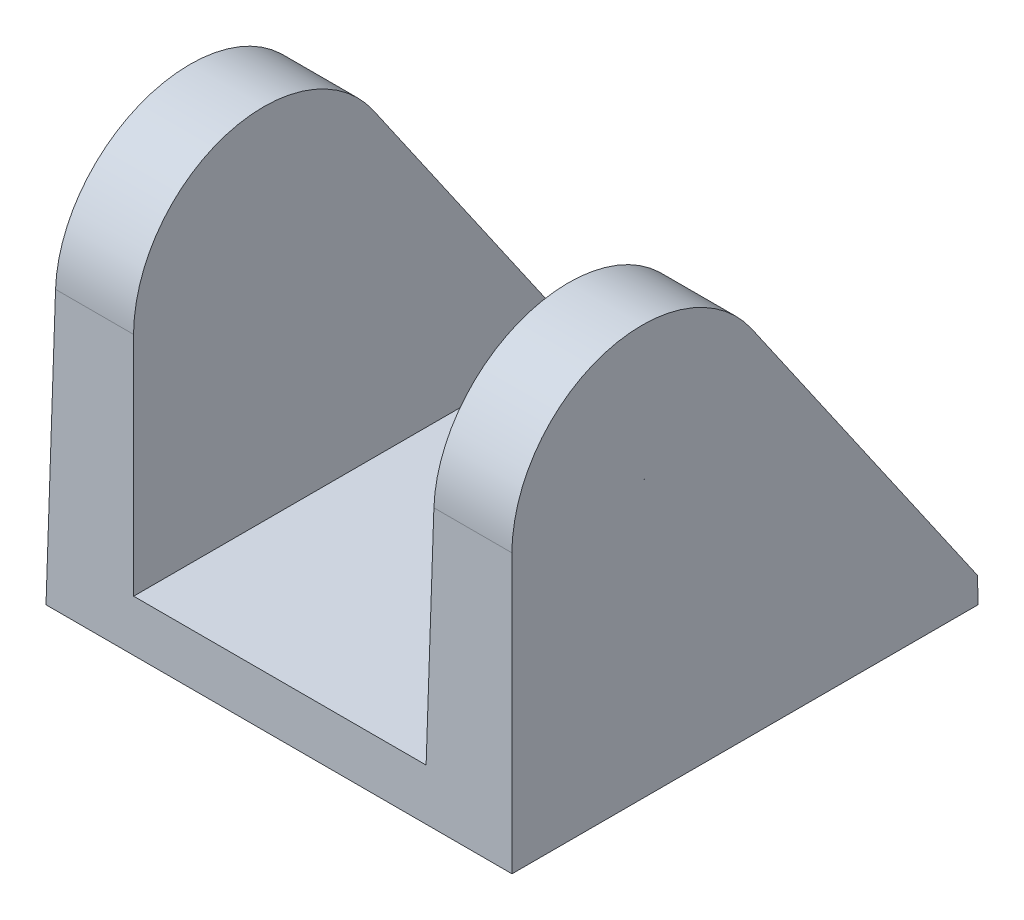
ISO-10303-21;
HEADER;
FILE_DESCRIPTION(('STEP AP214'),'2;1');
FILE_NAME('part.step','',(''),(''),'','','');
FILE_SCHEMA(('AUTOMOTIVE_DESIGN { 1 0 10303 214 1 1 1 1 }'));
ENDSEC;
DATA;
#1=APPLICATION_CONTEXT('core data for automotive mechanical design processes');
#2=APPLICATION_PROTOCOL_DEFINITION('international standard','automotive_design',2000,#1);
#3=PRODUCT_CONTEXT('',#1,'mechanical');
#4=PRODUCT('Part','Part','',(#3));
#5=PRODUCT_RELATED_PRODUCT_CATEGORY('part','',(#4));
#6=PRODUCT_DEFINITION_FORMATION('','',#4);
#7=PRODUCT_DEFINITION_CONTEXT('part definition',#1,'design');
#8=PRODUCT_DEFINITION('design','',#6,#7);
#9=PRODUCT_DEFINITION_SHAPE('','',#8);
#10=(LENGTH_UNIT() NAMED_UNIT(*) SI_UNIT(.MILLI.,.METRE.));
#11=(NAMED_UNIT(*) PLANE_ANGLE_UNIT() SI_UNIT($,.RADIAN.));
#12=(NAMED_UNIT(*) SI_UNIT($,.STERADIAN.) SOLID_ANGLE_UNIT());
#13=UNCERTAINTY_MEASURE_WITH_UNIT(LENGTH_MEASURE(1.E-05),#10,'distance_accuracy_value','');
#14=(GEOMETRIC_REPRESENTATION_CONTEXT(3) GLOBAL_UNCERTAINTY_ASSIGNED_CONTEXT((#13)) GLOBAL_UNIT_ASSIGNED_CONTEXT((#10,
#11,#12)) REPRESENTATION_CONTEXT('',''));
#15=CARTESIAN_POINT('',(0.,0.,0.));
#16=DIRECTION('',(0.,0.,1.));
#17=DIRECTION('',(1.,0.,0.));
#18=AXIS2_PLACEMENT_3D('',#15,#16,#17);
#19=CARTESIAN_POINT('',(0.,34.1376,-17.2608121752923));
#20=DIRECTION('',(1.,0.,0.));
#21=DIRECTION('',(0.,0.,-1.));
#22=AXIS2_PLACEMENT_3D('',#19,#20,#21);
#23=CYLINDRICAL_SURFACE('',#22,0.0127);
#24=CARTESIAN_POINT('',(28.7665259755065,34.1376,-17.2608121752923));
#25=DIRECTION('',(0.999847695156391,0.0174524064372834,0.));
#26=DIRECTION('',(0.0174524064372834,-0.999847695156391,0.));
#27=AXIS2_PLACEMENT_3D('',#24,#25,#26);
#28=ELLIPSE('',#27,0.0127019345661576,0.0127);
#29=CARTESIAN_POINT('',(28.7667476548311,34.1249,-17.2608121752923));
#30=VERTEX_POINT('',#29);
#31=EDGE_CURVE('E132',#30,#30,#28,.F.);
#32=ORIENTED_EDGE('',*,*,#31,.F.);
#33=EDGE_LOOP('',(#32));
#34=FACE_BOUND('',#33,.T.);
#35=CARTESIAN_POINT('',(18.9138394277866,34.1376,-17.2608121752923));
#36=DIRECTION('',(-0.999847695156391,0.0174524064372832,0.));
#37=DIRECTION('',(0.0174524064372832,0.999847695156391,0.));
#38=AXIS2_PLACEMENT_3D('',#35,#36,#37);
#39=ELLIPSE('',#38,0.0127019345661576,0.0127);
#40=CARTESIAN_POINT('',(18.9140611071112,34.1503,-17.2608121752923));
#41=VERTEX_POINT('',#40);
#42=EDGE_CURVE('E20',#41,#41,#39,.F.);
#43=ORIENTED_EDGE('',*,*,#42,.F.);
#44=EDGE_LOOP('',(#43));
#45=FACE_BOUND('',#44,.T.);
#46=ADVANCED_FACE('F16',(#34,#45),#23,.F.);
#47=CARTESIAN_POINT('',(-18.4288050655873,6.35,0.));
#48=DIRECTION('',(0.999847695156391,0.017452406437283,0.));
#49=DIRECTION('',(-0.017452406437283,0.999847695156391,0.));
#50=AXIS2_PLACEMENT_3D('',#47,#48,#49);
#51=PLANE('',#50);
#52=CARTESIAN_POINT('',(-18.9138394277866,34.1376,-17.2608121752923));
#53=DIRECTION('',(0.999847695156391,0.017452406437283,0.));
#54=DIRECTION('',(0.017452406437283,-0.999847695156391,0.));
#55=AXIS2_PLACEMENT_3D('',#52,#53,#54);
#56=ELLIPSE('',#55,0.0127019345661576,0.0127);
#57=CARTESIAN_POINT('',(-18.913617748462,34.1249,-17.2608121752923));
#58=VERTEX_POINT('',#57);
#59=EDGE_CURVE('E141',#58,#58,#56,.F.);
#60=ORIENTED_EDGE('',*,*,#59,.T.);
#61=EDGE_LOOP('',(#60));
#62=FACE_BOUND('',#61,.T.);
#63=DIRECTION('',(0.017449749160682,-0.999695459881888,0.0174497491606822));
#64=VECTOR('',#63,1.);
#65=CARTESIAN_POINT('',(-18.9189153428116,34.4283989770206,-0.600949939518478));
#66=LINE('',#65,#64);
#67=CARTESIAN_POINT('',(-18.9189153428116,34.4283989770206,-0.600949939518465));
#68=VERTEX_POINT('',#67);
#69=CARTESIAN_POINT('',(-18.4288050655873,6.35,-0.1108396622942));
#70=VERTEX_POINT('',#69);
#71=EDGE_CURVE('E158',#68,#70,#66,.T.);
#72=ORIENTED_EDGE('',*,*,#71,.T.);
#73=DIRECTION('',(0.,0.,1.));
#74=VECTOR('',#73,1.);
#75=CARTESIAN_POINT('',(-18.4288050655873,6.35,0.));
#76=LINE('',#75,#74);
#77=CARTESIAN_POINT('',(-18.4288050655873,6.35,-56.5453772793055));
#78=VERTEX_POINT('',#77);
#79=EDGE_CURVE('E145',#78,#70,#76,.T.);
#80=ORIENTED_EDGE('',*,*,#79,.F.);
#81=DIRECTION('',(-0.0143893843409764,0.824367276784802,0.56587236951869));
#82=VECTOR('',#81,1.);
#83=CARTESIAN_POINT('',(-18.4288050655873,6.35,-56.5453772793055));
#84=LINE('',#83,#82);
#85=CARTESIAN_POINT('',(-19.0784366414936,43.5673680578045,-30.9981717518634));
#86=VERTEX_POINT('',#85);
#87=EDGE_CURVE('E95',#78,#86,#84,.T.);
#88=ORIENTED_EDGE('',*,*,#87,.T.);
#89=CARTESIAN_POINT('',(-18.9138394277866,34.1376,-17.2608121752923));
#90=DIRECTION('',(0.999847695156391,0.017452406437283,0.));
#91=DIRECTION('',(0.017452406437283,-0.999847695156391,0.));
#92=AXIS2_PLACEMENT_3D('',#89,#90,#91);
#93=ELLIPSE('',#92,16.6649381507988,16.6624);
#94=EDGE_CURVE('E108',#68,#86,#93,.F.);
#95=ORIENTED_EDGE('',*,*,#94,.F.);
#96=EDGE_LOOP('',(#72,#80,#88,#95));
#97=FACE_BOUND('',#96,.T.);
#98=ADVANCED_FACE('F262',(#62,#97),#51,.T.);
#99=CARTESIAN_POINT('',(19.2124414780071,51.2445,-0.110839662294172));
#100=DIRECTION('',(-0.999847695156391,0.0174524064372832,0.));
#101=DIRECTION('',(0.,0.,-1.));
#102=AXIS2_PLACEMENT_3D('',#99,#100,#101);
#103=PLANE('',#102);
#104=ORIENTED_EDGE('',*,*,#42,.T.);
#105=EDGE_LOOP('',(#104));
#106=FACE_BOUND('',#105,.T.);
#107=DIRECTION('',(0.,0.,1.));
#108=VECTOR('',#107,1.);
#109=CARTESIAN_POINT('',(18.4288050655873,6.35,0.));
#110=LINE('',#109,#108);
#111=CARTESIAN_POINT('',(18.4288050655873,6.35,-0.11083966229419));
#112=VERTEX_POINT('',#111);
#113=CARTESIAN_POINT('',(18.4288050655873,6.35,-56.5453772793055));
#114=VERTEX_POINT('',#113);
#115=EDGE_CURVE('E176',#112,#114,#110,.F.);
#116=ORIENTED_EDGE('',*,*,#115,.F.);
#117=DIRECTION('',(0.017449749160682,0.999695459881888,-0.0174497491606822));
#118=VECTOR('',#117,1.);
#119=CARTESIAN_POINT('',(18.4288050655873,6.35,-0.1108396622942));
#120=LINE('',#119,#118);
#121=CARTESIAN_POINT('',(18.9189153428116,34.4283989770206,-0.600949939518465));
#122=VERTEX_POINT('',#121);
#123=EDGE_CURVE('E91',#112,#122,#120,.T.);
#124=ORIENTED_EDGE('',*,*,#123,.T.);
#125=CARTESIAN_POINT('',(18.9138394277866,34.1376,-17.2608121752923));
#126=DIRECTION('',(-0.999847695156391,0.0174524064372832,0.));
#127=DIRECTION('',(0.0174524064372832,0.999847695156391,0.));
#128=AXIS2_PLACEMENT_3D('',#125,#126,#127);
#129=ELLIPSE('',#128,16.6649381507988,16.6624);
#130=CARTESIAN_POINT('',(19.0784366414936,43.5673680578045,-30.9981717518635));
#131=VERTEX_POINT('',#130);
#132=EDGE_CURVE('E84',#131,#122,#129,.F.);
#133=ORIENTED_EDGE('',*,*,#132,.F.);
#134=DIRECTION('',(-0.0143893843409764,-0.824367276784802,-0.56587236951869));
#135=VECTOR('',#134,1.);
#136=CARTESIAN_POINT('',(19.0784366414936,43.5673680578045,-30.9981717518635));
#137=LINE('',#136,#135);
#138=EDGE_CURVE('E88',#131,#114,#137,.T.);
#139=ORIENTED_EDGE('',*,*,#138,.T.);
#140=EDGE_LOOP('',(#116,#124,#133,#139));
#141=FACE_BOUND('',#140,.T.);
#142=ADVANCED_FACE('F86',(#106,#141),#103,.T.);
#143=CARTESIAN_POINT('',(0.,34.1376,-17.2608121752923));
#144=DIRECTION('',(1.,0.,0.));
#145=DIRECTION('',(0.,0.,-1.));
#146=AXIS2_PLACEMENT_3D('',#143,#144,#145);
#147=CYLINDRICAL_SURFACE('',#146,16.6624);
#148=CARTESIAN_POINT('',(28.7665259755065,34.1376,-17.2608121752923));
#149=DIRECTION('',(0.999847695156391,0.0174524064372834,0.));
#150=DIRECTION('',(0.0174524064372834,-0.999847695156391,0.));
#151=AXIS2_PLACEMENT_3D('',#148,#149,#150);
#152=ELLIPSE('',#151,16.6649381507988,16.6624);
#153=CARTESIAN_POINT('',(28.6019287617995,43.5673680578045,-30.9981717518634));
#154=VERTEX_POINT('',#153);
#155=CARTESIAN_POINT('',(28.7614500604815,34.4283989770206,-0.600949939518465));
#156=VERTEX_POINT('',#155);
#157=EDGE_CURVE('E99',#154,#156,#152,.T.);
#158=ORIENTED_EDGE('',*,*,#157,.F.);
#159=DIRECTION('',(1.,0.,0.));
#160=VECTOR('',#159,1.);
#161=CARTESIAN_POINT('',(0.,43.5673680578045,-30.9981717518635));
#162=LINE('',#161,#160);
#163=EDGE_CURVE('E97',#154,#131,#162,.F.);
#164=ORIENTED_EDGE('',*,*,#163,.T.);
#165=ORIENTED_EDGE('',*,*,#132,.T.);
#166=DIRECTION('',(1.,0.,0.));
#167=VECTOR('',#166,1.);
#168=CARTESIAN_POINT('',(0.,34.4283989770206,-0.600949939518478));
#169=LINE('',#168,#167);
#170=EDGE_CURVE('E180',#122,#156,#169,.T.);
#171=ORIENTED_EDGE('',*,*,#170,.T.);
#172=EDGE_LOOP('',(#158,#164,#165,#171));
#173=FACE_BOUND('',#172,.T.);
#174=ADVANCED_FACE('F98',(#173),#147,.T.);
#175=CARTESIAN_POINT('',(0.,3.175,-58.7248));
#176=DIRECTION('',(0.,-0.565930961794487,0.824452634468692));
#177=DIRECTION('',(0.,-0.824452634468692,-0.565930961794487));
#178=AXIS2_PLACEMENT_3D('',#175,#176,#177);
#179=PLANE('',#178);
#180=ORIENTED_EDGE('',*,*,#163,.F.);
#181=DIRECTION('',(-0.0143893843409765,0.824367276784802,0.565872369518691));
#182=VECTOR('',#181,1.);
#183=CARTESIAN_POINT('',(29.3069801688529,3.17500000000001,-58.7248));
#184=LINE('',#183,#182);
#185=CARTESIAN_POINT('',(29.3069801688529,3.175,-58.7248));
#186=VERTEX_POINT('',#185);
#187=EDGE_CURVE('E136',#186,#154,#184,.T.);
#188=ORIENTED_EDGE('',*,*,#187,.F.);
#189=DIRECTION('',(1.,0.,0.));
#190=VECTOR('',#189,1.);
#191=CARTESIAN_POINT('',(-19.7114667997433,3.175,-58.7248));
#192=LINE('',#191,#190);
#193=CARTESIAN_POINT('',(-29.3069801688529,3.175,-58.7248));
#194=VERTEX_POINT('',#193);
#195=EDGE_CURVE('E140',#186,#194,#192,.F.);
#196=ORIENTED_EDGE('',*,*,#195,.T.);
#197=DIRECTION('',(-0.0143893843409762,-0.824367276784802,-0.56587236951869));
#198=VECTOR('',#197,1.);
#199=CARTESIAN_POINT('',(-28.6019287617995,43.5673680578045,-30.9981717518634));
#200=LINE('',#199,#198);
#201=CARTESIAN_POINT('',(-28.6019287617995,43.5673680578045,-30.9981717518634));
#202=VERTEX_POINT('',#201);
#203=EDGE_CURVE('E172',#202,#194,#200,.T.);
#204=ORIENTED_EDGE('',*,*,#203,.F.);
#205=DIRECTION('',(1.,0.,0.));
#206=VECTOR('',#205,1.);
#207=CARTESIAN_POINT('',(0.,43.5673680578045,-30.9981717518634));
#208=LINE('',#207,#206);
#209=EDGE_CURVE('E111',#86,#202,#208,.F.);
#210=ORIENTED_EDGE('',*,*,#209,.F.);
#211=ORIENTED_EDGE('',*,*,#87,.F.);
#212=DIRECTION('',(1.,0.,0.));
#213=VECTOR('',#212,1.);
#214=CARTESIAN_POINT('',(0.,6.35,-56.5453772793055));
#215=LINE('',#214,#213);
#216=EDGE_CURVE('E106',#114,#78,#215,.F.);
#217=ORIENTED_EDGE('',*,*,#216,.F.);
#218=ORIENTED_EDGE('',*,*,#138,.F.);
#219=EDGE_LOOP('',(#180,#188,#196,#204,#210,#211,#217,#218));
#220=FACE_BOUND('',#219,.T.);
#221=ADVANCED_FACE('F104',(#220),#179,.F.);
#222=CARTESIAN_POINT('',(0.,34.1376,-17.2608121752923));
#223=DIRECTION('',(1.,0.,0.));
#224=DIRECTION('',(0.,0.,-1.));
#225=AXIS2_PLACEMENT_3D('',#222,#223,#224);
#226=CYLINDRICAL_SURFACE('',#225,16.6624);
#227=ORIENTED_EDGE('',*,*,#94,.T.);
#228=ORIENTED_EDGE('',*,*,#209,.T.);
#229=CARTESIAN_POINT('',(-28.7665259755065,34.1376,-17.2608121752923));
#230=DIRECTION('',(-0.999847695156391,0.017452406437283,0.));
#231=DIRECTION('',(0.017452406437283,0.999847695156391,0.));
#232=AXIS2_PLACEMENT_3D('',#229,#230,#231);
#233=ELLIPSE('',#232,16.6649381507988,16.6624);
#234=CARTESIAN_POINT('',(-28.7614500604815,34.4283989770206,-0.600949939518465));
#235=VERTEX_POINT('',#234);
#236=EDGE_CURVE('E129',#235,#202,#233,.T.);
#237=ORIENTED_EDGE('',*,*,#236,.F.);
#238=DIRECTION('',(1.,0.,0.));
#239=VECTOR('',#238,1.);
#240=CARTESIAN_POINT('',(0.,34.4283989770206,-0.600949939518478));
#241=LINE('',#240,#239);
#242=EDGE_CURVE('E155',#235,#68,#241,.T.);
#243=ORIENTED_EDGE('',*,*,#242,.T.);
#244=EDGE_LOOP('',(#227,#228,#237,#243));
#245=FACE_BOUND('',#244,.T.);
#246=ADVANCED_FACE('F263',(#245),#226,.T.);
#247=CARTESIAN_POINT('',(0.,34.1376,-17.2608121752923));
#248=DIRECTION('',(1.,0.,0.));
#249=DIRECTION('',(0.,0.,-1.));
#250=AXIS2_PLACEMENT_3D('',#247,#248,#249);
#251=CYLINDRICAL_SURFACE('',#250,0.0127);
#252=ORIENTED_EDGE('',*,*,#59,.F.);
#253=EDGE_LOOP('',(#252));
#254=FACE_BOUND('',#253,.T.);
#255=CARTESIAN_POINT('',(-28.7665259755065,34.1376,-17.2608121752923));
#256=DIRECTION('',(-0.999847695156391,0.017452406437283,0.));
#257=DIRECTION('',(0.017452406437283,0.999847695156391,0.));
#258=AXIS2_PLACEMENT_3D('',#255,#256,#257);
#259=ELLIPSE('',#258,0.0127019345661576,0.0127);
#260=CARTESIAN_POINT('',(-28.7663042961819,34.1503,-17.2608121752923));
#261=VERTEX_POINT('',#260);
#262=EDGE_CURVE('E126',#261,#261,#259,.F.);
#263=ORIENTED_EDGE('',*,*,#262,.F.);
#264=EDGE_LOOP('',(#263));
#265=FACE_BOUND('',#264,.T.);
#266=ADVANCED_FACE('F257',(#254,#265),#251,.F.);
#267=CARTESIAN_POINT('',(0.,6.35,0.));
#268=DIRECTION('',(0.,1.,0.));
#269=DIRECTION('',(0.,0.,1.));
#270=AXIS2_PLACEMENT_3D('',#267,#268,#269);
#271=PLANE('',#270);
#272=CARTESIAN_POINT('',(0.,6.34999999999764,-29.3624));
#273=DIRECTION('',(0.,1.,0.));
#274=DIRECTION('',(0.,0.,1.));
#275=AXIS2_PLACEMENT_3D('',#272,#273,#274);
#276=CIRCLE('',#275,0.178980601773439);
#277=CARTESIAN_POINT('',(0.,6.34999999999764,-29.1834193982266));
#278=VERTEX_POINT('',#277);
#279=EDGE_CURVE('E122',#278,#278,#276,.F.);
#280=ORIENTED_EDGE('',*,*,#279,.T.);
#281=EDGE_LOOP('',(#280));
#282=FACE_BOUND('',#281,.T.);
#283=DIRECTION('',(1.,0.,0.));
#284=VECTOR('',#283,1.);
#285=CARTESIAN_POINT('',(0.,6.35,-0.1108396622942));
#286=LINE('',#285,#284);
#287=EDGE_CURVE('E181',#70,#112,#286,.T.);
#288=ORIENTED_EDGE('',*,*,#287,.T.);
#289=ORIENTED_EDGE('',*,*,#115,.T.);
#290=ORIENTED_EDGE('',*,*,#216,.T.);
#291=ORIENTED_EDGE('',*,*,#79,.T.);
#292=EDGE_LOOP('',(#288,#289,#290,#291));
#293=FACE_BOUND('',#292,.T.);
#294=ADVANCED_FACE('F254',(#282,#293),#271,.T.);
#295=CARTESIAN_POINT('',(-19.7114667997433,19.9715488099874,-58.7248));
#296=DIRECTION('',(0.,0.,1.));
#297=DIRECTION('',(1.,0.,0.));
#298=AXIS2_PLACEMENT_3D('',#295,#296,#297);
#299=PLANE('',#298);
#300=DIRECTION('',(-0.0174524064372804,0.999847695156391,0.));
#301=VECTOR('',#300,1.);
#302=CARTESIAN_POINT('',(28.9146077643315,25.654,-58.7248));
#303=LINE('',#302,#301);
#304=CARTESIAN_POINT('',(29.3624,0.,-58.7248));
#305=VERTEX_POINT('',#304);
#306=EDGE_CURVE('E138',#305,#186,#303,.T.);
#307=ORIENTED_EDGE('',*,*,#306,.F.);
#308=DIRECTION('',(1.,0.,0.));
#309=VECTOR('',#308,1.);
#310=CARTESIAN_POINT('',(-29.3624,0.,-58.7248));
#311=LINE('',#310,#309);
#312=CARTESIAN_POINT('',(-29.3624,0.,-58.7248));
#313=VERTEX_POINT('',#312);
#314=EDGE_CURVE('E125',#313,#305,#311,.T.);
#315=ORIENTED_EDGE('',*,*,#314,.F.);
#316=DIRECTION('',(-0.017452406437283,-0.999847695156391,0.));
#317=VECTOR('',#316,1.);
#318=CARTESIAN_POINT('',(-28.4756827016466,50.8,-58.7248));
#319=LINE('',#318,#317);
#320=EDGE_CURVE('E169',#194,#313,#319,.T.);
#321=ORIENTED_EDGE('',*,*,#320,.F.);
#322=ORIENTED_EDGE('',*,*,#195,.F.);
#323=EDGE_LOOP('',(#307,#315,#321,#322));
#324=FACE_BOUND('',#323,.T.);
#325=ADVANCED_FACE('F219',(#324),#299,.F.);
#326=CARTESIAN_POINT('',(28.466815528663,51.308,-58.7248));
#327=DIRECTION('',(0.999847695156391,0.0174524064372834,0.));
#328=DIRECTION('',(0.,0.,1.));
#329=AXIS2_PLACEMENT_3D('',#326,#327,#328);
#330=PLANE('',#329);
#331=ORIENTED_EDGE('',*,*,#31,.T.);
#332=EDGE_LOOP('',(#331));
#333=FACE_BOUND('',#332,.T.);
#334=ORIENTED_EDGE('',*,*,#306,.T.);
#335=ORIENTED_EDGE('',*,*,#187,.T.);
#336=ORIENTED_EDGE('',*,*,#157,.T.);
#337=DIRECTION('',(0.0174497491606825,-0.999695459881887,0.0174497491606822));
#338=VECTOR('',#337,1.);
#339=CARTESIAN_POINT('',(28.7614500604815,34.4283989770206,-0.600949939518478));
#340=LINE('',#339,#338);
#341=CARTESIAN_POINT('',(29.3624,0.,0.));
#342=VERTEX_POINT('',#341);
#343=EDGE_CURVE('E135',#156,#342,#340,.T.);
#344=ORIENTED_EDGE('',*,*,#343,.T.);
#345=DIRECTION('',(0.,0.,-1.));
#346=VECTOR('',#345,1.);
#347=CARTESIAN_POINT('',(29.3624,0.,0.));
#348=LINE('',#347,#346);
#349=EDGE_CURVE('E166',#305,#342,#348,.F.);
#350=ORIENTED_EDGE('',*,*,#349,.F.);
#351=EDGE_LOOP('',(#334,#335,#336,#344,#350));
#352=FACE_BOUND('',#351,.T.);
#353=ADVANCED_FACE('F18',(#333,#352),#330,.T.);
#354=CARTESIAN_POINT('',(0.,50.8,-0.886717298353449));
#355=DIRECTION('',(0.,-0.017452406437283,-0.999847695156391));
#356=DIRECTION('',(0.,0.999847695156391,-0.017452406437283));
#357=AXIS2_PLACEMENT_3D('',#354,#355,#356);
#358=PLANE('',#357);
#359=ORIENTED_EDGE('',*,*,#123,.F.);
#360=ORIENTED_EDGE('',*,*,#287,.F.);
#361=ORIENTED_EDGE('',*,*,#71,.F.);
#362=ORIENTED_EDGE('',*,*,#242,.F.);
#363=DIRECTION('',(0.0174497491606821,0.999695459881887,-0.0174497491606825));
#364=VECTOR('',#363,1.);
#365=CARTESIAN_POINT('',(-29.3624,0.,0.));
#366=LINE('',#365,#364);
#367=CARTESIAN_POINT('',(-29.3624,0.,0.));
#368=VERTEX_POINT('',#367);
#369=EDGE_CURVE('E35',#368,#235,#366,.T.);
#370=ORIENTED_EDGE('',*,*,#369,.F.);
#371=DIRECTION('',(1.,0.,0.));
#372=VECTOR('',#371,1.);
#373=CARTESIAN_POINT('',(-29.3624,0.,0.));
#374=LINE('',#373,#372);
#375=EDGE_CURVE('E161',#342,#368,#374,.F.);
#376=ORIENTED_EDGE('',*,*,#375,.F.);
#377=ORIENTED_EDGE('',*,*,#343,.F.);
#378=ORIENTED_EDGE('',*,*,#170,.F.);
#379=EDGE_LOOP('',(#359,#360,#361,#362,#370,#376,#377,#378));
#380=FACE_BOUND('',#379,.T.);
#381=ADVANCED_FACE('F228',(#380),#358,.F.);
#382=CARTESIAN_POINT('',(-28.4756827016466,50.8,0.));
#383=DIRECTION('',(-0.999847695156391,0.017452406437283,0.));
#384=DIRECTION('',(-0.017452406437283,-0.999847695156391,0.));
#385=AXIS2_PLACEMENT_3D('',#382,#383,#384);
#386=PLANE('',#385);
#387=ORIENTED_EDGE('',*,*,#262,.T.);
#388=EDGE_LOOP('',(#387));
#389=FACE_BOUND('',#388,.T.);
#390=ORIENTED_EDGE('',*,*,#369,.T.);
#391=ORIENTED_EDGE('',*,*,#236,.T.);
#392=ORIENTED_EDGE('',*,*,#203,.T.);
#393=ORIENTED_EDGE('',*,*,#320,.T.);
#394=DIRECTION('',(0.,0.,-1.));
#395=VECTOR('',#394,1.);
#396=CARTESIAN_POINT('',(-29.3624,0.,0.));
#397=LINE('',#396,#395);
#398=EDGE_CURVE('E26',#368,#313,#397,.T.);
#399=ORIENTED_EDGE('',*,*,#398,.F.);
#400=EDGE_LOOP('',(#390,#391,#392,#393,#399));
#401=FACE_BOUND('',#400,.T.);
#402=ADVANCED_FACE('F222',(#389,#401),#386,.T.);
#403=CARTESIAN_POINT('',(0.,6.34999999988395,-29.3624));
#404=DIRECTION('',(0.,1.,0.));
#405=DIRECTION('',(0.,0.,1.));
#406=AXIS2_PLACEMENT_3D('',#403,#404,#405);
#407=CONICAL_SURFACE('',#406,0.178980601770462,0.0261799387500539);
#408=CARTESIAN_POINT('',(0.,0.,-29.3624));
#409=DIRECTION('',(0.,1.,0.));
#410=DIRECTION('',(0.,0.,1.));
#411=AXIS2_PLACEMENT_3D('',#408,#409,#410);
#412=CIRCLE('',#411,0.0126999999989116);
#413=CARTESIAN_POINT('',(0.,0.,-29.3497000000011));
#414=VERTEX_POINT('',#413);
#415=EDGE_CURVE('E11',#414,#414,#412,.T.);
#416=CARTESIAN_POINT('',(0.,0.,-29.3497000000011));
#417=CARTESIAN_POINT('',(0.,0.0661458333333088,-29.3479679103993));
#418=CARTESIAN_POINT('',(0.,0.132291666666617,-29.3462358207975));
#419=CARTESIAN_POINT('',(0.,0.264583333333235,-29.3427716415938));
#420=CARTESIAN_POINT('',(0.,0.330729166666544,-29.341039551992));
#421=CARTESIAN_POINT('',(0.,0.463020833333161,-29.3375753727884));
#422=CARTESIAN_POINT('',(0.,0.52916666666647,-29.3358432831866));
#423=CARTESIAN_POINT('',(0.,0.661458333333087,-29.3323791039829));
#424=CARTESIAN_POINT('',(0.,0.727604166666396,-29.3306470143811));
#425=CARTESIAN_POINT('',(0.,0.859895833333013,-29.3271828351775));
#426=CARTESIAN_POINT('',(0.,0.926041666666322,-29.3254507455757));
#427=CARTESIAN_POINT('',(0.,1.05833333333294,-29.321986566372));
#428=CARTESIAN_POINT('',(0.,1.12447916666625,-29.3202544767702));
#429=CARTESIAN_POINT('',(0.,1.25677083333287,-29.3167902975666));
#430=CARTESIAN_POINT('',(0.,1.32291666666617,-29.3150582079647));
#431=CARTESIAN_POINT('',(0.,1.45520833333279,-29.3115940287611));
#432=CARTESIAN_POINT('',(0.,1.5213541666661,-29.3098619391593));
#433=CARTESIAN_POINT('',(0.,1.65364583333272,-29.3063977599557));
#434=CARTESIAN_POINT('',(0.,1.71979166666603,-29.3046656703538));
#435=CARTESIAN_POINT('',(0.,1.85208333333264,-29.3012014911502));
#436=CARTESIAN_POINT('',(0.,1.91822916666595,-29.2994694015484));
#437=CARTESIAN_POINT('',(0.,2.05052083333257,-29.2960052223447));
#438=CARTESIAN_POINT('',(0.,2.11666666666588,-29.2942731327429));
#439=CARTESIAN_POINT('',(0.,2.2489583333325,-29.2908089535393));
#440=CARTESIAN_POINT('',(0.,2.3151041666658,-29.2890768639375));
#441=CARTESIAN_POINT('',(0.,2.44739583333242,-29.2856126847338));
#442=CARTESIAN_POINT('',(0.,2.51354166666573,-29.283880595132));
#443=CARTESIAN_POINT('',(0.,2.64583333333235,-29.2804164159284));
#444=CARTESIAN_POINT('',(0.,2.71197916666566,-29.2786843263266));
#445=CARTESIAN_POINT('',(0.,2.84427083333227,-29.2752201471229));
#446=CARTESIAN_POINT('',(0.,2.91041666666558,-29.2734880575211));
#447=CARTESIAN_POINT('',(0.,3.0427083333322,-29.2700238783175));
#448=CARTESIAN_POINT('',(0.,3.10885416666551,-29.2682917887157));
#449=CARTESIAN_POINT('',(0.,3.24114583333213,-29.264827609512));
#450=CARTESIAN_POINT('',(0.,3.30729166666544,-29.2630955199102));
#451=CARTESIAN_POINT('',(0.,3.43958333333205,-29.2596313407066));
#452=CARTESIAN_POINT('',(0.,3.50572916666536,-29.2578992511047));
#453=CARTESIAN_POINT('',(0.,3.63802083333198,-29.2544350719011));
#454=CARTESIAN_POINT('',(0.,3.70416666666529,-29.2527029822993));
#455=CARTESIAN_POINT('',(0.,3.83645833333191,-29.2492388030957));
#456=CARTESIAN_POINT('',(0.,3.90260416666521,-29.2475067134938));
#457=CARTESIAN_POINT('',(0.,4.03489583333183,-29.2440425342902));
#458=CARTESIAN_POINT('',(0.,4.10104166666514,-29.2423104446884));
#459=CARTESIAN_POINT('',(0.,4.23333333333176,-29.2388462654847));
#460=CARTESIAN_POINT('',(0.,4.29947916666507,-29.2371141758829));
#461=CARTESIAN_POINT('',(0.,4.43177083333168,-29.2336499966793));
#462=CARTESIAN_POINT('',(0.,4.49791666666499,-29.2319179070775));
#463=CARTESIAN_POINT('',(0.,4.63020833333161,-29.2284537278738));
#464=CARTESIAN_POINT('',(0.,4.69635416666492,-29.226721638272));
#465=CARTESIAN_POINT('',(0.,4.82864583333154,-29.2232574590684));
#466=CARTESIAN_POINT('',(0.,4.89479166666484,-29.2215253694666));
#467=CARTESIAN_POINT('',(0.,5.02708333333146,-29.2180611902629));
#468=CARTESIAN_POINT('',(0.,5.09322916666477,-29.2163291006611));
#469=CARTESIAN_POINT('',(0.,5.22552083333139,-29.2128649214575));
#470=CARTESIAN_POINT('',(0.,5.2916666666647,-29.2111328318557));
#471=CARTESIAN_POINT('',(0.,5.42395833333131,-29.207668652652));
#472=CARTESIAN_POINT('',(0.,5.49010416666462,-29.2059365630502));
#473=CARTESIAN_POINT('',(0.,5.62239583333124,-29.2024723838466));
#474=CARTESIAN_POINT('',(0.,5.68854166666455,-29.2007402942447));
#475=CARTESIAN_POINT('',(0.,5.82083333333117,-29.1972761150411));
#476=CARTESIAN_POINT('',(0.,5.88697916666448,-29.1955440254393));
#477=CARTESIAN_POINT('',(0.,6.01927083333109,-29.1920798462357));
#478=CARTESIAN_POINT('',(0.,6.0854166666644,-29.1903477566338));
#479=CARTESIAN_POINT('',(0.,6.21770833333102,-29.1868835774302));
#480=CARTESIAN_POINT('',(0.,6.28385416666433,-29.1851514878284));
#481=CARTESIAN_POINT('',(0.,6.34999999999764,-29.1834193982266));
#482=B_SPLINE_CURVE_WITH_KNOTS('',3,(#416,#417,#418,#419,#420,#421,#422,#423,#424,#425,#426,
#427,#428,#429,#430,#431,#432,#433,#434,#435,#436,#437,#438,#439,#440,#441,#442,#443,#444,#445,
#446,#447,#448,#449,#450,#451,#452,#453,#454,#455,#456,#457,#458,#459,#460,#461,#462,#463,#464,
#465,#466,#467,#468,#469,#470,#471,#472,#473,#474,#475,#476,#477,#478,#479,#480,#481),
.UNSPECIFIED.,.F.,.F.,(4,2,2,2,2,2,2,2,2,2,2,2,2,2,2,2,2,2,2,2,2,2,2,2,2,2,2,2,2,2,2,2,4),(0.,
0.198505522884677,0.397011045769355,0.595516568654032,0.79402209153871,0.992527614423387,
1.19103313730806,1.38953866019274,1.58804418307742,1.7865497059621,1.98505522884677,
2.18356075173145,2.38206627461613,2.58057179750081,2.77907732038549,2.97758284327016,
3.17608836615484,3.37459388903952,3.57309941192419,3.77160493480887,3.97011045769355,
4.16861598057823,4.36712150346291,4.56562702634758,4.76413254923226,4.96263807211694,
5.16114359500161,5.35964911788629,5.55815464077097,5.75666016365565,5.95516568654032,
6.153671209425,6.35217673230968),.UNSPECIFIED.);
#483=EDGE_CURVE('BSEAM237',#414,#278,#482,.T.);
#484=ORIENTED_EDGE('',*,*,#415,.F.);
#485=ORIENTED_EDGE('',*,*,#279,.F.);
#486=ORIENTED_EDGE('',*,*,#483,.T.);
#487=ORIENTED_EDGE('',*,*,#483,.F.);
#488=EDGE_LOOP('',(#484,#486,#485,#487));
#489=FACE_BOUND('',#488,.T.);
#490=ADVANCED_FACE('F237',(#489),#407,.F.);
#491=CARTESIAN_POINT('',(-29.3624,0.,0.));
#492=DIRECTION('',(0.,-1.,0.));
#493=DIRECTION('',(0.,0.,-1.));
#494=AXIS2_PLACEMENT_3D('',#491,#492,#493);
#495=PLANE('',#494);
#496=ORIENTED_EDGE('',*,*,#415,.T.);
#497=EDGE_LOOP('',(#496));
#498=FACE_BOUND('',#497,.T.);
#499=ORIENTED_EDGE('',*,*,#375,.T.);
#500=ORIENTED_EDGE('',*,*,#398,.T.);
#501=ORIENTED_EDGE('',*,*,#314,.T.);
#502=ORIENTED_EDGE('',*,*,#349,.T.);
#503=EDGE_LOOP('',(#499,#500,#501,#502));
#504=FACE_BOUND('',#503,.T.);
#505=ADVANCED_FACE('F215',(#498,#504),#495,.T.);
#506=CLOSED_SHELL('',(#46,#98,#142,#174,#221,#246,#266,#294,#325,#353,#381,#402,#490,#505));
#507=MANIFOLD_SOLID_BREP('B1',#506);
#508=ADVANCED_BREP_SHAPE_REPRESENTATION('',(#18,#507),#14);
#509=SHAPE_DEFINITION_REPRESENTATION(#9,#508);
ENDSEC;
END-ISO-10303-21;
